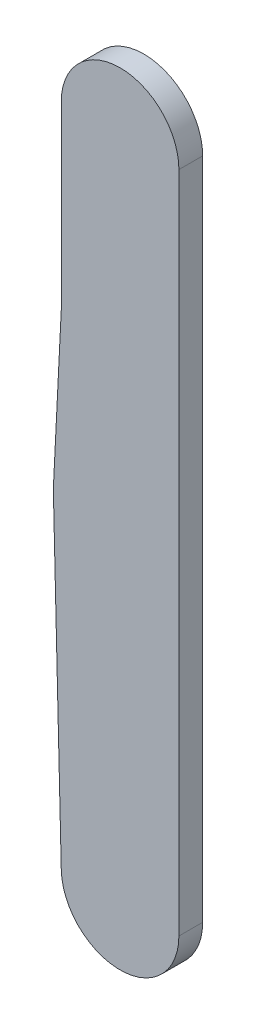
ISO-10303-21;
HEADER;
FILE_DESCRIPTION(('STEP AP214'),'2;1');
FILE_NAME('part.step','',(''),(''),'','','');
FILE_SCHEMA(('AUTOMOTIVE_DESIGN { 1 0 10303 214 1 1 1 1 }'));
ENDSEC;
DATA;
#1=APPLICATION_CONTEXT('core data for automotive mechanical design processes');
#2=APPLICATION_PROTOCOL_DEFINITION('international standard','automotive_design',2000,#1);
#3=PRODUCT_CONTEXT('',#1,'mechanical');
#4=PRODUCT('Part','Part','',(#3));
#5=PRODUCT_RELATED_PRODUCT_CATEGORY('part','',(#4));
#6=PRODUCT_DEFINITION_FORMATION('','',#4);
#7=PRODUCT_DEFINITION_CONTEXT('part definition',#1,'design');
#8=PRODUCT_DEFINITION('design','',#6,#7);
#9=PRODUCT_DEFINITION_SHAPE('','',#8);
#10=(LENGTH_UNIT() NAMED_UNIT(*) SI_UNIT(.MILLI.,.METRE.));
#11=(NAMED_UNIT(*) PLANE_ANGLE_UNIT() SI_UNIT($,.RADIAN.));
#12=(NAMED_UNIT(*) SI_UNIT($,.STERADIAN.) SOLID_ANGLE_UNIT());
#13=UNCERTAINTY_MEASURE_WITH_UNIT(LENGTH_MEASURE(1.E-05),#10,'distance_accuracy_value','');
#14=(GEOMETRIC_REPRESENTATION_CONTEXT(3) GLOBAL_UNCERTAINTY_ASSIGNED_CONTEXT((#13)) GLOBAL_UNIT_ASSIGNED_CONTEXT((#10,
#11,#12)) REPRESENTATION_CONTEXT('',''));
#15=CARTESIAN_POINT('',(0.,0.,0.));
#16=DIRECTION('',(0.,0.,1.));
#17=DIRECTION('',(1.,0.,0.));
#18=AXIS2_PLACEMENT_3D('',#15,#16,#17);
#19=CARTESIAN_POINT('',(0.,0.,15.));
#20=DIRECTION('',(0.,0.,-1.));
#21=DIRECTION('',(-1.,0.,0.));
#22=AXIS2_PLACEMENT_3D('',#19,#20,#21);
#23=CYLINDRICAL_SURFACE('',#22,37.13);
#24=CARTESIAN_POINT('',(0.,0.,0.));
#25=DIRECTION('',(0.,0.,1.));
#26=DIRECTION('',(1.,0.,0.));
#27=AXIS2_PLACEMENT_3D('',#24,#25,#26);
#28=CIRCLE('',#27,37.13);
#29=CARTESIAN_POINT('',(37.13,0.,0.));
#30=VERTEX_POINT('',#29);
#31=CARTESIAN_POINT('',(-37.13,0.,0.));
#32=VERTEX_POINT('',#31);
#33=EDGE_CURVE('E87',#30,#32,#28,.T.);
#34=ORIENTED_EDGE('',*,*,#33,.T.);
#35=DIRECTION('',(0.,0.,-1.));
#36=VECTOR('',#35,1.);
#37=CARTESIAN_POINT('',(-37.13,0.,15.));
#38=LINE('',#37,#36);
#39=CARTESIAN_POINT('',(-37.13,0.,15.));
#40=VERTEX_POINT('',#39);
#41=EDGE_CURVE('E11',#40,#32,#38,.T.);
#42=ORIENTED_EDGE('',*,*,#41,.F.);
#43=CARTESIAN_POINT('',(0.,0.,15.));
#44=DIRECTION('',(0.,0.,1.));
#45=DIRECTION('',(1.,0.,0.));
#46=AXIS2_PLACEMENT_3D('',#43,#44,#45);
#47=CIRCLE('',#46,37.13);
#48=CARTESIAN_POINT('',(37.13,0.,15.));
#49=VERTEX_POINT('',#48);
#50=EDGE_CURVE('E110',#49,#40,#47,.T.);
#51=ORIENTED_EDGE('',*,*,#50,.F.);
#52=DIRECTION('',(0.,0.,-1.));
#53=VECTOR('',#52,1.);
#54=CARTESIAN_POINT('',(37.13,0.,15.));
#55=LINE('',#54,#53);
#56=EDGE_CURVE('E100',#49,#30,#55,.T.);
#57=ORIENTED_EDGE('',*,*,#56,.T.);
#58=EDGE_LOOP('',(#34,#42,#51,#57));
#59=FACE_BOUND('',#58,.T.);
#60=ADVANCED_FACE('F31',(#59),#23,.T.);
#61=CARTESIAN_POINT('',(-37.13,0.,15.));
#62=DIRECTION('',(1.,0.,0.));
#63=DIRECTION('',(0.,1.,0.));
#64=AXIS2_PLACEMENT_3D('',#61,#62,#63);
#65=PLANE('',#64);
#66=DIRECTION('',(0.,-1.,0.));
#67=VECTOR('',#66,1.);
#68=CARTESIAN_POINT('',(-37.13,0.,0.));
#69=LINE('',#68,#67);
#70=CARTESIAN_POINT('',(-37.13,-114.,0.));
#71=VERTEX_POINT('',#70);
#72=EDGE_CURVE('E83',#32,#71,#69,.T.);
#73=ORIENTED_EDGE('',*,*,#72,.T.);
#74=DIRECTION('',(0.,0.,-1.));
#75=VECTOR('',#74,1.);
#76=CARTESIAN_POINT('',(-37.13,-114.,15.));
#77=LINE('',#76,#75);
#78=CARTESIAN_POINT('',(-37.13,-114.,15.));
#79=VERTEX_POINT('',#78);
#80=EDGE_CURVE('E38',#79,#71,#77,.T.);
#81=ORIENTED_EDGE('',*,*,#80,.F.);
#82=DIRECTION('',(0.,-1.,0.));
#83=VECTOR('',#82,1.);
#84=CARTESIAN_POINT('',(-37.13,0.,15.));
#85=LINE('',#84,#83);
#86=EDGE_CURVE('E96',#40,#79,#85,.T.);
#87=ORIENTED_EDGE('',*,*,#86,.F.);
#88=ORIENTED_EDGE('',*,*,#41,.T.);
#89=EDGE_LOOP('',(#73,#81,#87,#88));
#90=FACE_BOUND('',#89,.T.);
#91=ADVANCED_FACE('F95',(#90),#65,.F.);
#92=CARTESIAN_POINT('',(-37.13,-114.,15.));
#93=DIRECTION('',(0.998752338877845,-0.0499376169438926,0.));
#94=DIRECTION('',(0.0499376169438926,0.998752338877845,0.));
#95=AXIS2_PLACEMENT_3D('',#92,#93,#94);
#96=PLANE('',#95);
#97=DIRECTION('',(-0.0499376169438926,-0.998752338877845,0.));
#98=VECTOR('',#97,1.);
#99=CARTESIAN_POINT('',(-37.13,-114.,0.));
#100=LINE('',#99,#98);
#101=CARTESIAN_POINT('',(-42.13,-214.,0.));
#102=VERTEX_POINT('',#101);
#103=EDGE_CURVE('E89',#71,#102,#100,.T.);
#104=ORIENTED_EDGE('',*,*,#103,.T.);
#105=DIRECTION('',(0.,0.,-1.));
#106=VECTOR('',#105,1.);
#107=CARTESIAN_POINT('',(-42.13,-214.,15.));
#108=LINE('',#107,#106);
#109=CARTESIAN_POINT('',(-42.13,-214.,15.));
#110=VERTEX_POINT('',#109);
#111=EDGE_CURVE('E126',#110,#102,#108,.T.);
#112=ORIENTED_EDGE('',*,*,#111,.F.);
#113=DIRECTION('',(-0.0499376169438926,-0.998752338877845,0.));
#114=VECTOR('',#113,1.);
#115=CARTESIAN_POINT('',(-37.13,-114.,15.));
#116=LINE('',#115,#114);
#117=EDGE_CURVE('E113',#79,#110,#116,.T.);
#118=ORIENTED_EDGE('',*,*,#117,.F.);
#119=ORIENTED_EDGE('',*,*,#80,.T.);
#120=EDGE_LOOP('',(#104,#112,#118,#119));
#121=FACE_BOUND('',#120,.T.);
#122=ADVANCED_FACE('F130',(#121),#96,.F.);
#123=CARTESIAN_POINT('',(-42.13,-214.,15.));
#124=DIRECTION('',(0.999703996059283,0.0243294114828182,0.));
#125=DIRECTION('',(-0.0243294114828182,0.999703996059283,0.));
#126=AXIS2_PLACEMENT_3D('',#123,#124,#125);
#127=PLANE('',#126);
#128=DIRECTION('',(0.0243294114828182,-0.999703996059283,0.));
#129=VECTOR('',#128,1.);
#130=CARTESIAN_POINT('',(-42.13,-214.,0.));
#131=LINE('',#130,#129);
#132=CARTESIAN_POINT('',(-37.1190093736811,-419.903351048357,0.));
#133=VERTEX_POINT('',#132);
#134=EDGE_CURVE('E104',#102,#133,#131,.T.);
#135=ORIENTED_EDGE('',*,*,#134,.T.);
#136=DIRECTION('',(0.,0.,-1.));
#137=VECTOR('',#136,1.);
#138=CARTESIAN_POINT('',(-37.1190093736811,-419.903351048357,15.));
#139=LINE('',#138,#137);
#140=CARTESIAN_POINT('',(-37.1190093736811,-419.903351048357,15.));
#141=VERTEX_POINT('',#140);
#142=EDGE_CURVE('E123',#141,#133,#139,.T.);
#143=ORIENTED_EDGE('',*,*,#142,.F.);
#144=DIRECTION('',(0.0243294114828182,-0.999703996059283,0.));
#145=VECTOR('',#144,1.);
#146=CARTESIAN_POINT('',(-42.13,-214.,15.));
#147=LINE('',#146,#145);
#148=EDGE_CURVE('E115',#110,#141,#147,.T.);
#149=ORIENTED_EDGE('',*,*,#148,.F.);
#150=ORIENTED_EDGE('',*,*,#111,.T.);
#151=EDGE_LOOP('',(#135,#143,#149,#150));
#152=FACE_BOUND('',#151,.T.);
#153=ADVANCED_FACE('F136',(#152),#127,.F.);
#154=CARTESIAN_POINT('',(0.,-419.,15.));
#155=DIRECTION('',(0.,0.,-1.));
#156=DIRECTION('',(-1.,0.,0.));
#157=AXIS2_PLACEMENT_3D('',#154,#155,#156);
#158=CYLINDRICAL_SURFACE('',#157,37.1299999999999);
#159=CARTESIAN_POINT('',(0.,-419.,0.));
#160=DIRECTION('',(0.,0.,1.));
#161=DIRECTION('',(1.,0.,0.));
#162=AXIS2_PLACEMENT_3D('',#159,#160,#161);
#163=CIRCLE('',#162,37.1299999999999);
#164=CARTESIAN_POINT('',(37.13,-419.,0.));
#165=VERTEX_POINT('',#164);
#166=EDGE_CURVE('E106',#133,#165,#163,.T.);
#167=ORIENTED_EDGE('',*,*,#166,.T.);
#168=DIRECTION('',(0.,0.,-1.));
#169=VECTOR('',#168,1.);
#170=CARTESIAN_POINT('',(37.13,-419.,15.));
#171=LINE('',#170,#169);
#172=CARTESIAN_POINT('',(37.13,-419.,15.));
#173=VERTEX_POINT('',#172);
#174=EDGE_CURVE('E120',#173,#165,#171,.T.);
#175=ORIENTED_EDGE('',*,*,#174,.F.);
#176=CARTESIAN_POINT('',(0.,-419.,15.));
#177=DIRECTION('',(0.,0.,1.));
#178=DIRECTION('',(1.,0.,0.));
#179=AXIS2_PLACEMENT_3D('',#176,#177,#178);
#180=CIRCLE('',#179,37.1299999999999);
#181=EDGE_CURVE('E50',#141,#173,#180,.T.);
#182=ORIENTED_EDGE('',*,*,#181,.F.);
#183=ORIENTED_EDGE('',*,*,#142,.T.);
#184=EDGE_LOOP('',(#167,#175,#182,#183));
#185=FACE_BOUND('',#184,.T.);
#186=ADVANCED_FACE('F139',(#185),#158,.T.);
#187=CARTESIAN_POINT('',(37.13,0.,15.));
#188=DIRECTION('',(-1.,0.,0.));
#189=DIRECTION('',(0.,-1.,0.));
#190=AXIS2_PLACEMENT_3D('',#187,#188,#189);
#191=PLANE('',#190);
#192=DIRECTION('',(0.,1.,0.));
#193=VECTOR('',#192,1.);
#194=CARTESIAN_POINT('',(37.13,0.,0.));
#195=LINE('',#194,#193);
#196=EDGE_CURVE('E108',#165,#30,#195,.T.);
#197=ORIENTED_EDGE('',*,*,#196,.T.);
#198=ORIENTED_EDGE('',*,*,#56,.F.);
#199=DIRECTION('',(0.,1.,0.));
#200=VECTOR('',#199,1.);
#201=CARTESIAN_POINT('',(37.13,0.,15.));
#202=LINE('',#201,#200);
#203=EDGE_CURVE('E45',#173,#49,#202,.T.);
#204=ORIENTED_EDGE('',*,*,#203,.F.);
#205=ORIENTED_EDGE('',*,*,#174,.T.);
#206=EDGE_LOOP('',(#197,#198,#204,#205));
#207=FACE_BOUND('',#206,.T.);
#208=ADVANCED_FACE('F141',(#207),#191,.F.);
#209=CARTESIAN_POINT('',(0.,0.,15.));
#210=DIRECTION('',(0.,0.,1.));
#211=DIRECTION('',(1.,0.,0.));
#212=AXIS2_PLACEMENT_3D('',#209,#210,#211);
#213=PLANE('',#212);
#214=ORIENTED_EDGE('',*,*,#50,.T.);
#215=ORIENTED_EDGE('',*,*,#86,.T.);
#216=ORIENTED_EDGE('',*,*,#117,.T.);
#217=ORIENTED_EDGE('',*,*,#148,.T.);
#218=ORIENTED_EDGE('',*,*,#181,.T.);
#219=ORIENTED_EDGE('',*,*,#203,.T.);
#220=EDGE_LOOP('',(#214,#215,#216,#217,#218,#219));
#221=FACE_BOUND('',#220,.T.);
#222=ADVANCED_FACE('F133',(#221),#213,.T.);
#223=CARTESIAN_POINT('',(0.,0.,0.));
#224=DIRECTION('',(0.,0.,1.));
#225=DIRECTION('',(1.,0.,0.));
#226=AXIS2_PLACEMENT_3D('',#223,#224,#225);
#227=PLANE('',#226);
#228=ORIENTED_EDGE('',*,*,#33,.F.);
#229=ORIENTED_EDGE('',*,*,#196,.F.);
#230=ORIENTED_EDGE('',*,*,#166,.F.);
#231=ORIENTED_EDGE('',*,*,#134,.F.);
#232=ORIENTED_EDGE('',*,*,#103,.F.);
#233=ORIENTED_EDGE('',*,*,#72,.F.);
#234=EDGE_LOOP('',(#228,#229,#230,#231,#232,#233));
#235=FACE_BOUND('',#234,.T.);
#236=ADVANCED_FACE('F84',(#235),#227,.F.);
#237=CLOSED_SHELL('',(#60,#91,#122,#153,#186,#208,#222,#236));
#238=MANIFOLD_SOLID_BREP('B2',#237);
#239=ADVANCED_BREP_SHAPE_REPRESENTATION('',(#18,#238),#14);
#240=SHAPE_DEFINITION_REPRESENTATION(#9,#239);
ENDSEC;
END-ISO-10303-21;
